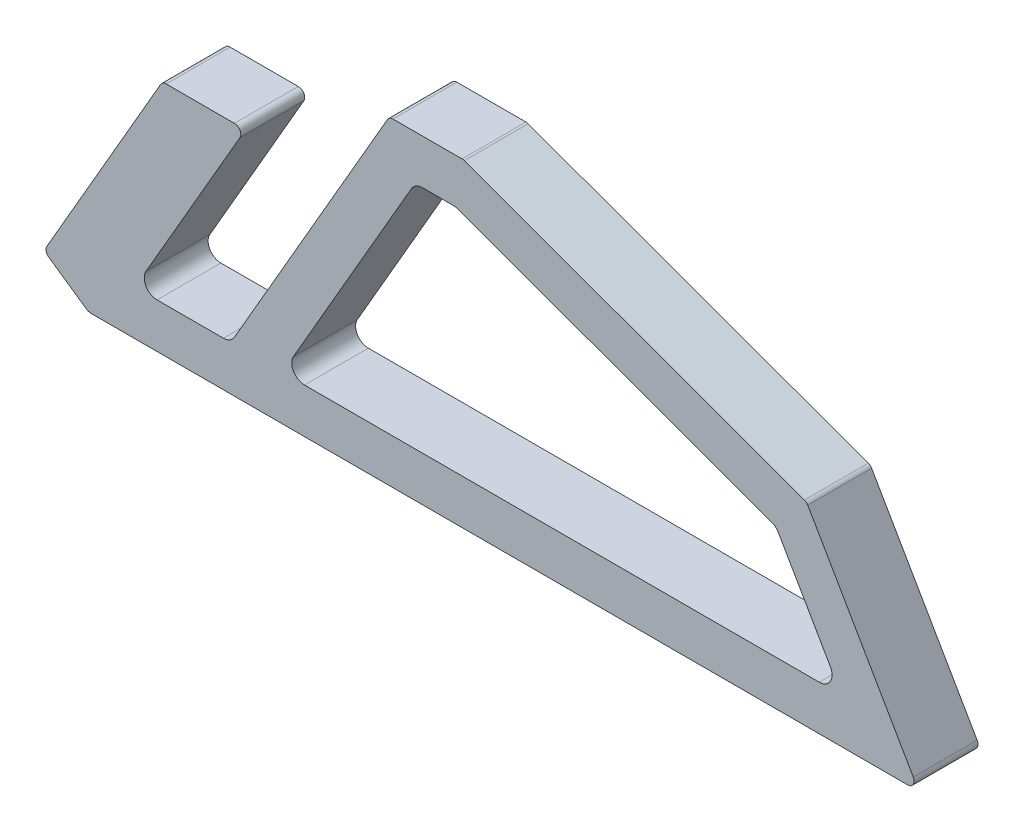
from build123d import *

# Parameters (mm, degrees)
BOSS_EXTRUDE1_DEPTH = 10
FILLET1_R           = 2
FILLET2_R           = 1


with BuildPart() as part:
    # Sketch1 → Boss-Extrude1 (new body)
    with BuildSketch(Plane.XY):
        Polygon((0, 0), (130, 0), (112.433259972, 30.426486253), (58.655472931, 50), (47.08468145, 50), (22.258619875, 7), (7.247512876, 7), (24.568020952, 37), (11.568020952, 37), (-7, 4.839244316), align=None)
        Polygon((107.644977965, 24.720033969), (57.421184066, 43), (51.126133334, 43), (30.341523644, 7), (117.875644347, 7), align=None, mode=Mode.SUBTRACT)
    extrude(amount=BOSS_EXTRUDE1_DEPTH)

    # Fillet1
    fillet1_edges = [part.edges().sort_by_distance(p)[0] for p in [
        (7.247512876, 7, 5),
        (22.258619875, 7, 5),
        (117.875644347, 7, 5),
        (107.644977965, 24.720033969, 5),
        (57.421184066, 43, 5),
        (51.126133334, 43, 5),
        (30.341523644, 7, 5),
    ]]
    fillet(fillet1_edges, radius=FILLET1_R)

    # Fillet2
    fillet2_edges = [part.edges().sort_by_distance(p)[0] for p in [
        (-7, 4.839244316, 5),
        (11.568020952, 37, 5),
        (24.568020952, 37, 5),
        (47.08468145, 50, 5),
        (58.655472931, 50, 5),
        (112.433259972, 30.426486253, 5),
        (130, 0, 5),
        (0, 0, 5),
    ]]
    fillet(fillet2_edges, radius=FILLET2_R)


solid = part.part
